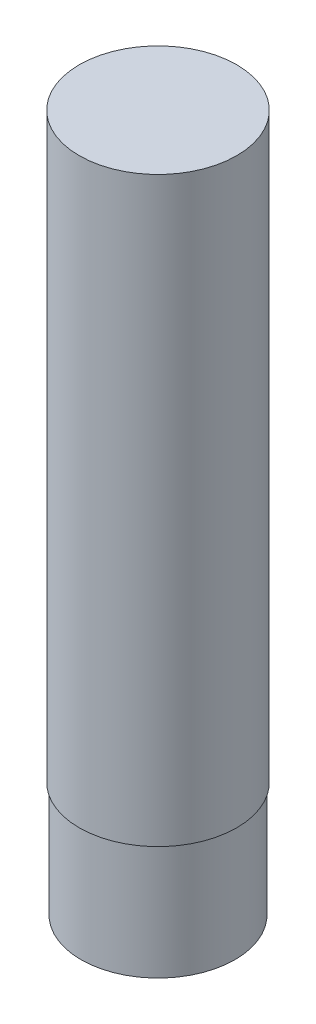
from build123d import *

# Parameters (mm, degrees)
SKETCH1_R           = 29.21
BOSS_EXTRUDE1_DEPTH = 215.9
SKETCH2_R           = 28.575
BOSS_EXTRUDE2_DEPTH = 42.672


with BuildPart() as part:
    # Sketch1 → Boss-Extrude1 (new body)
    with BuildSketch(Plane(origin=(0, 0, 0), x_dir=(1, 0, 0), z_dir=(0, 1, 0))):
        with Locations(Location((0, 0, 0), (0, 0, 270))):
            Circle(SKETCH1_R)
    extrude(amount=BOSS_EXTRUDE1_DEPTH)

    # Sketch2 → Boss-Extrude2 (add)
    with BuildSketch(Plane.XZ):
        with Locations(Location((0, 0, 0), (0, 0, 90))):
            Circle(SKETCH2_R)
    extrude(amount=BOSS_EXTRUDE2_DEPTH)


solid = part.part
